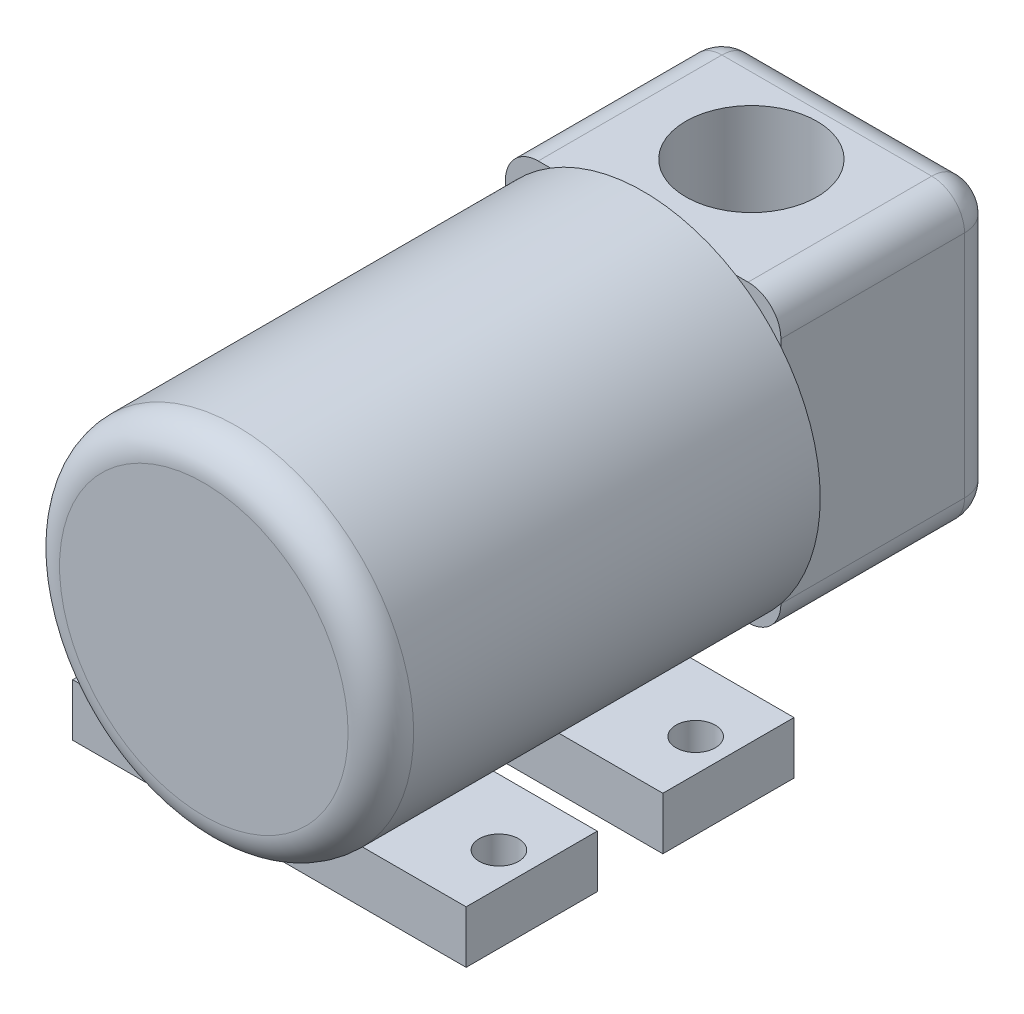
from build123d import *

# Parameters (mm, degrees)
SKETCH1_R                 = 27
BOSS_EXTRUDE1_DEPTH       = 67
SKETCH3_W                 = 42
SKETCH3_H                 = 45
BOSS_EXTRUDE2_DEPTH       = 33
SKETCH4_R                 = 10
CUT_EXTRUDE1_DEPTH        = 84
FILLET2_R                 = 5
FILLET3_R                 = 5
SKETCH8_W                 = 20
SKETCH8_H                 = 60
BOSS_EXTRUDE5_DEPTH       = 8
F_6_0MM_DOWEL_HOLE1_D     = 6
F_6_0MM_DOWEL_HOLE1_DEPTH = 8.001


with BuildPart() as part:
    # Sketch1 → Boss-Extrude1 (new body)
    with BuildSketch(Plane.XY):
        Circle(SKETCH1_R)
    extrude(amount=-BOSS_EXTRUDE1_DEPTH)

    # Sketch3 → Boss-Extrude2 (add)
    with BuildSketch(Plane(origin=(0, 0, -67), x_dir=(-1, 0, 0), z_dir=(0, 0, -1))):
        with Locations((0, 0.5)):
            Rectangle(SKETCH3_W, SKETCH3_H)
    extrude(amount=BOSS_EXTRUDE2_DEPTH)

    # Sketch4 → Cut-Extrude1 (cut)
    with BuildSketch(Plane(origin=(0, 23, 0), x_dir=(1, 0, 0), z_dir=(0, 1, 0))):
        with Locations(Location((0, 83.5, 0), (0, 0, 180))):
            Circle(SKETCH4_R)
    extrude(amount=-CUT_EXTRUDE1_DEPTH, mode=Mode.SUBTRACT)

    # Fillet2
    fillet2_edges = [part.edges().sort_by_distance(p)[0] for p in [
        (21, 23, -83.5),
        (21, -22, -83.5),
        (-21, -22, -83.5),
        (-21, 23, -83.5),
        (21, 0.5, -100),
        (0, -22, -100),
        (-21, 0.5, -100),
        (0, 23, -100),
    ]]
    fillet(fillet2_edges, radius=FILLET2_R)

    # Fillet3
    fillet3_edges = [part.edges().sort_by_distance(p)[0] for p in [
        (-27, 0, 0),
    ]]
    fillet(fillet3_edges, radius=FILLET3_R)

    # Sketch8 → Boss-Extrude5 (add)
    with BuildSketch(Plane(origin=(1, -32, 0), x_dir=(0, 0, -1), z_dir=(0, 1, 0))):
        with Locations((20, 1)):
            Rectangle(SKETCH8_W, SKETCH8_H)
        with Locations((50, 1)):
            Rectangle(SKETCH8_W, SKETCH8_H)
    extrude(amount=BOSS_EXTRUDE5_DEPTH)

    # 6.0mm Dowel Hole1
    with Locations(Plane(origin=(0, -24, 0), x_dir=(1, 0, 0), z_dir=(0, 1, 0))):
        with Locations((-25, 50), (-25, 20)):
            f_6_0mm_dowel_hole1 = Hole(F_6_0MM_DOWEL_HOLE1_D / 2, depth=F_6_0MM_DOWEL_HOLE1_DEPTH)

    # Mirror2: 6.0mm Dowel Hole1 across plane
    add(f_6_0mm_dowel_hole1.mirror(Plane.ZY), mode=Mode.SUBTRACT)


solid = part.part
